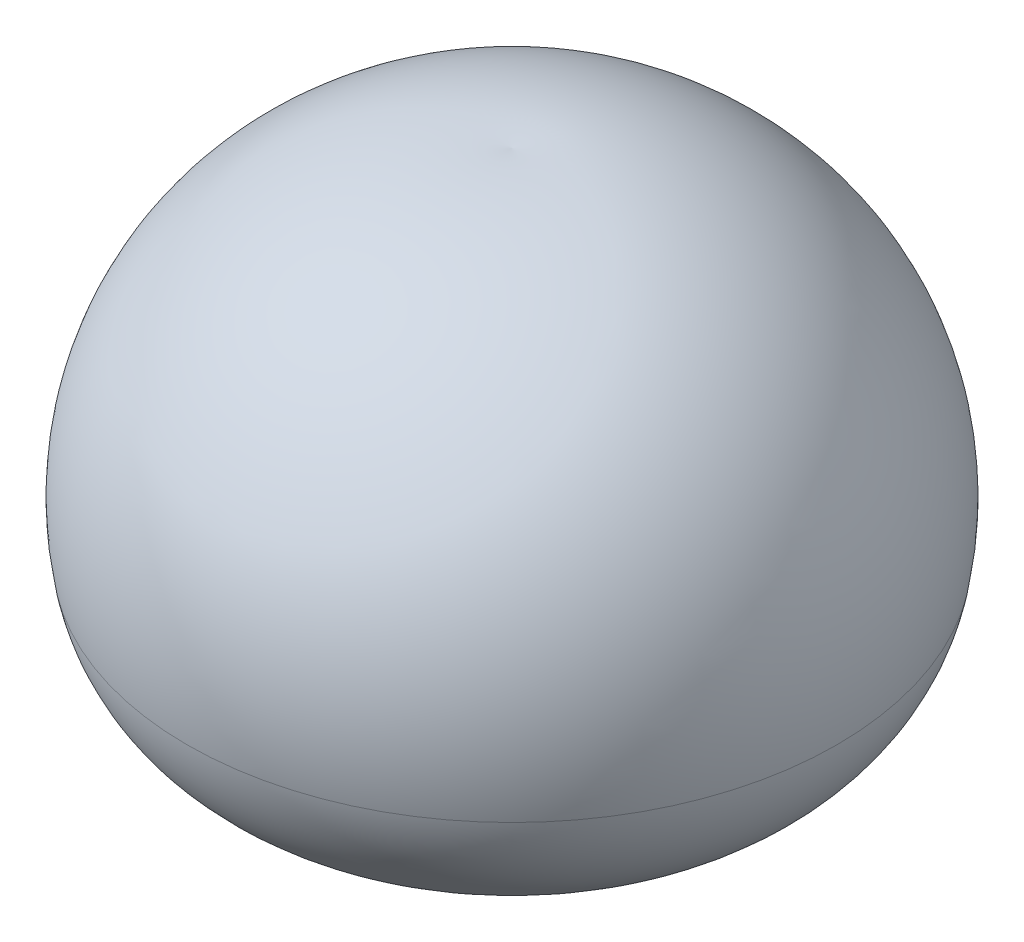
ISO-10303-21;
HEADER;
FILE_DESCRIPTION(('STEP AP214'),'2;1');
FILE_NAME('part.step','',(''),(''),'','','');
FILE_SCHEMA(('AUTOMOTIVE_DESIGN { 1 0 10303 214 1 1 1 1 }'));
ENDSEC;
DATA;
#1=APPLICATION_CONTEXT('core data for automotive mechanical design processes');
#2=APPLICATION_PROTOCOL_DEFINITION('international standard','automotive_design',2000,#1);
#3=PRODUCT_CONTEXT('',#1,'mechanical');
#4=PRODUCT('Part','Part','',(#3));
#5=PRODUCT_RELATED_PRODUCT_CATEGORY('part','',(#4));
#6=PRODUCT_DEFINITION_FORMATION('','',#4);
#7=PRODUCT_DEFINITION_CONTEXT('part definition',#1,'design');
#8=PRODUCT_DEFINITION('design','',#6,#7);
#9=PRODUCT_DEFINITION_SHAPE('','',#8);
#10=(LENGTH_UNIT() NAMED_UNIT(*) SI_UNIT(.MILLI.,.METRE.));
#11=(NAMED_UNIT(*) PLANE_ANGLE_UNIT() SI_UNIT($,.RADIAN.));
#12=(NAMED_UNIT(*) SI_UNIT($,.STERADIAN.) SOLID_ANGLE_UNIT());
#13=UNCERTAINTY_MEASURE_WITH_UNIT(LENGTH_MEASURE(1.E-05),#10,'distance_accuracy_value','');
#14=(GEOMETRIC_REPRESENTATION_CONTEXT(3) GLOBAL_UNCERTAINTY_ASSIGNED_CONTEXT((#13)) GLOBAL_UNIT_ASSIGNED_CONTEXT((#10,
#11,#12)) REPRESENTATION_CONTEXT('',''));
#15=CARTESIAN_POINT('',(0.,0.,0.));
#16=DIRECTION('',(0.,0.,1.));
#17=DIRECTION('',(1.,0.,0.));
#18=AXIS2_PLACEMENT_3D('',#15,#16,#17);
#19=CARTESIAN_POINT('',(0.,607.,250.));
#20=DIRECTION('',(-1.,0.,0.));
#21=DIRECTION('',(0.,0.,1.));
#22=AXIS2_PLACEMENT_3D('',#19,#20,#21);
#23=CIRCLE('',#22,2846.96899196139);
#24=TRIMMED_CURVE('',#23,(PARAMETER_VALUE(-1.6587222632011)),(PARAMETER_VALUE(1.6587222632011)),
.T.,.PARAMETER.);
#25=CARTESIAN_POINT('',(0.,607.,0.));
#26=DIRECTION('',(0.,1.,0.));
#27=AXIS1_PLACEMENT('',#25,#26);
#28=SURFACE_OF_REVOLUTION('',#24,#27);
#29=CARTESIAN_POINT('',(0.,3442.97116367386,0.));
#30=VERTEX_POINT('',#29);
#31=VERTEX_LOOP('',#30);
#32=FACE_BOUND('',#31,.T.);
#33=CARTESIAN_POINT('',(0.,112.629022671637,0.));
#34=DIRECTION('',(0.,1.,0.));
#35=DIRECTION('',(0.,0.,1.));
#36=AXIS2_PLACEMENT_3D('',#33,#34,#35);
#37=CIRCLE('',#36,3053.71713586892);
#38=CARTESIAN_POINT('',(0.,112.629022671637,3053.71713586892));
#39=VERTEX_POINT('',#38);
#40=EDGE_CURVE('E42',#39,#39,#37,.T.);
#41=ORIENTED_EDGE('',*,*,#40,.T.);
#42=EDGE_LOOP('',(#41));
#43=FACE_BOUND('',#42,.T.);
#44=ADVANCED_FACE('F34',(#32,#43),#28,.T.);
#45=CARTESIAN_POINT('',(0.,403.831632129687,1402.22507102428));
#46=DIRECTION('',(-1.,0.,0.));
#47=DIRECTION('',(0.,0.,1.));
#48=AXIS2_PLACEMENT_3D('',#45,#46,#47);
#49=CIRCLE('',#48,1676.96899196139);
#50=TRIMMED_CURVE('',#49,(PARAMETER_VALUE(-2.561052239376)),(PARAMETER_VALUE(2.561052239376)),
.T.,.PARAMETER.);
#51=CARTESIAN_POINT('',(0.,403.831632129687,0.));
#52=DIRECTION('',(0.,1.,0.));
#53=AXIS1_PLACEMENT('',#51,#52);
#54=SURFACE_OF_REVOLUTION('',#50,#53);
#55=ORIENTED_EDGE('',*,*,#40,.F.);
#56=EDGE_LOOP('',(#55));
#57=FACE_BOUND('',#56,.T.);
#58=CARTESIAN_POINT('',(0.,-515.945433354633,0.));
#59=VERTEX_POINT('',#58);
#60=VERTEX_LOOP('',#59);
#61=FACE_BOUND('',#60,.T.);
#62=ADVANCED_FACE('F57',(#57,#61),#54,.T.);
#63=CLOSED_SHELL('',(#44,#62));
#64=CARTESIAN_POINT('',(0.,403.831632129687,-902.225071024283));
#65=DIRECTION('',(-1.,0.,0.));
#66=DIRECTION('',(0.,0.,1.));
#67=AXIS2_PLACEMENT_3D('',#64,#65,#66);
#68=CIRCLE('',#67,1676.96899196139);
#69=TRIMMED_CURVE('',#68,(PARAMETER_VALUE(-1.0027225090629)),(PARAMETER_VALUE(1.0027225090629)),
.T.,.PARAMETER.);
#70=CARTESIAN_POINT('',(0.,403.831632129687,0.));
#71=DIRECTION('',(0.,1.,0.));
#72=AXIS1_PLACEMENT('',#70,#71);
#73=SURFACE_OF_REVOLUTION('',#69,#72);
#74=CARTESIAN_POINT('',(0.,1288.75259533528,0.));
#75=DIRECTION('',(0.,1.,0.));
#76=DIRECTION('',(0.,0.,1.));
#77=AXIS2_PLACEMENT_3D('',#74,#75,#76);
#78=CIRCLE('',#77,522.253742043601);
#79=CARTESIAN_POINT('',(0.,1288.75259533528,522.253742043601));
#80=VERTEX_POINT('',#79);
#81=EDGE_CURVE('E11',#80,#80,#78,.T.);
#82=ORIENTED_EDGE('',*,*,#81,.F.);
#83=EDGE_LOOP('',(#82));
#84=FACE_BOUND('',#83,.T.);
#85=CARTESIAN_POINT('',(0.,1817.41393295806,0.));
#86=VERTEX_POINT('',#85);
#87=VERTEX_LOOP('',#86);
#88=FACE_BOUND('',#87,.T.);
#89=ADVANCED_FACE('F69',(#84,#88),#73,.F.);
#90=CARTESIAN_POINT('',(0.,607.,250.));
#91=DIRECTION('',(-1.,0.,0.));
#92=DIRECTION('',(0.,0.,1.));
#93=AXIS2_PLACEMENT_3D('',#90,#91,#92);
#94=CIRCLE('',#93,734.10401259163);
#95=TRIMMED_CURVE('',#94,(PARAMETER_VALUE(-1.91829940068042)),
(PARAMETER_VALUE(1.91829940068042)),.T.,.PARAMETER.);
#96=CARTESIAN_POINT('',(0.,607.,0.));
#97=DIRECTION('',(0.,1.,0.));
#98=AXIS1_PLACEMENT('',#96,#97);
#99=SURFACE_OF_REVOLUTION('',#95,#98);
#100=CARTESIAN_POINT('',(-1.11022302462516E-13,-83.2236603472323,0.));
#101=VERTEX_POINT('',#100);
#102=VERTEX_LOOP('',#101);
#103=FACE_BOUND('',#102,.T.);
#104=ORIENTED_EDGE('',*,*,#81,.T.);
#105=EDGE_LOOP('',(#104));
#106=FACE_BOUND('',#105,.T.);
#107=ADVANCED_FACE('F67',(#103,#106),#99,.F.);
#108=CLOSED_SHELL('',(#89,#107));
#109=ORIENTED_CLOSED_SHELL('',*,#108,.T.);
#110=BREP_WITH_VOIDS('B2',#63,(#109));
#111=ADVANCED_BREP_SHAPE_REPRESENTATION('',(#18,#110),#14);
#112=SHAPE_DEFINITION_REPRESENTATION(#9,#111);
ENDSEC;
END-ISO-10303-21;
